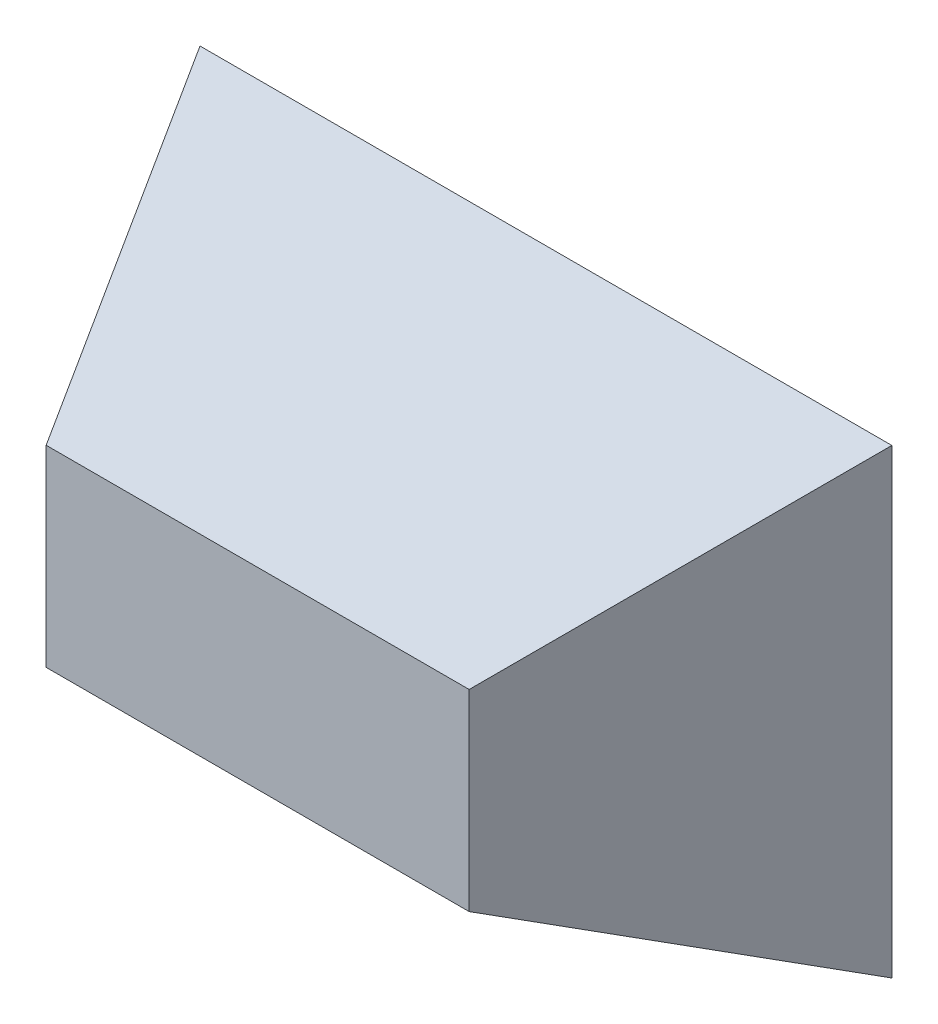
from build123d import *

# Parameters (mm, degrees)
SKETCH_1_W      = 120
SKETCH_1_H      = 80
EXTRUDE_1_DEPTH = 50
EXTRUDE_1_TAPER = 25


with BuildPart() as part:
    # Sketch 1 → Extrude 1 (new body)
    with BuildSketch(Plane.XY):
        Rectangle(SKETCH_1_W, SKETCH_1_H)
    extrude(amount=EXTRUDE_1_DEPTH, taper=EXTRUDE_1_TAPER)


solid = part.part
